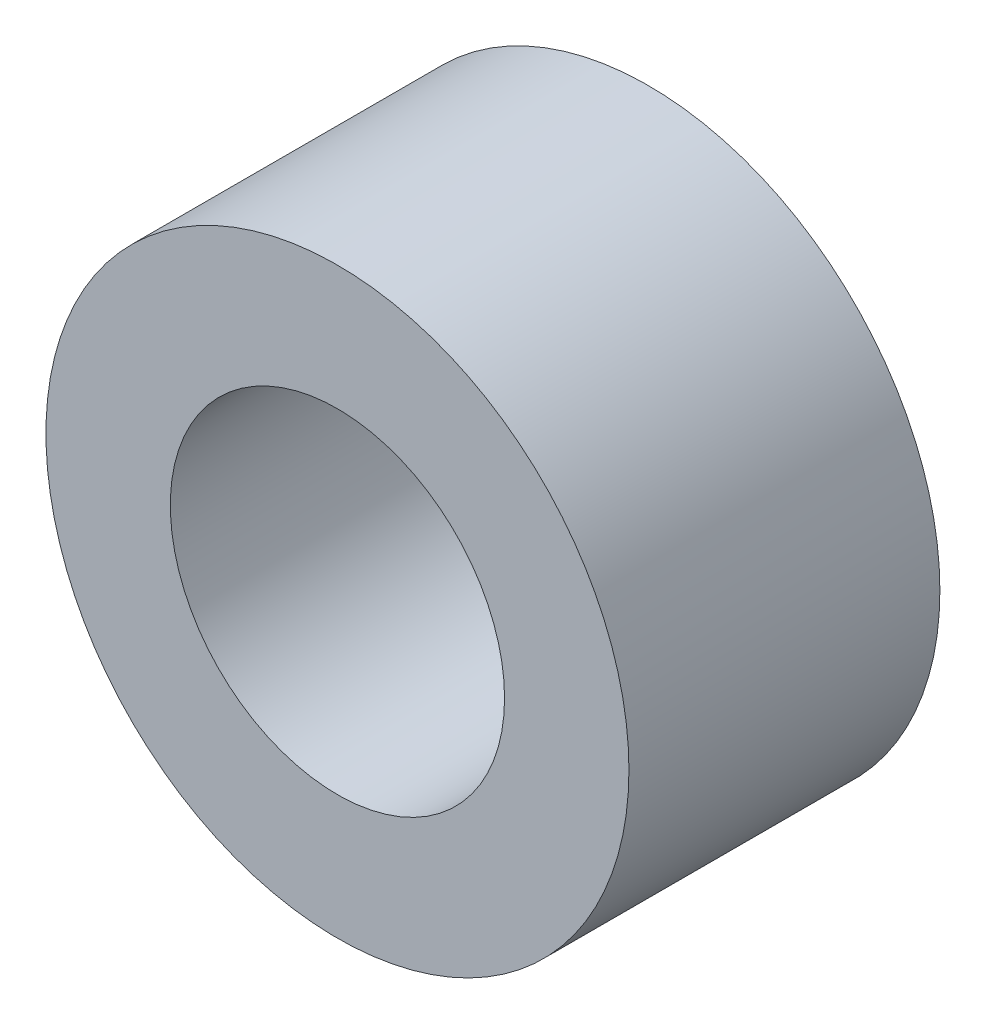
from build123d import *

# Parameters (mm, degrees)
SKETCH1_R           = 37.5
SKETCH1_R_2         = 21.5
BOSS_EXTRUDE1_DEPTH = 20


with BuildPart() as part:
    # Sketch1 → Boss-Extrude1 (new, symmetric)
    with BuildSketch(Plane.XY):
        Circle(SKETCH1_R)
        Circle(SKETCH1_R_2, mode=Mode.SUBTRACT)
    extrude(amount=BOSS_EXTRUDE1_DEPTH, both=True)


solid = part.part
